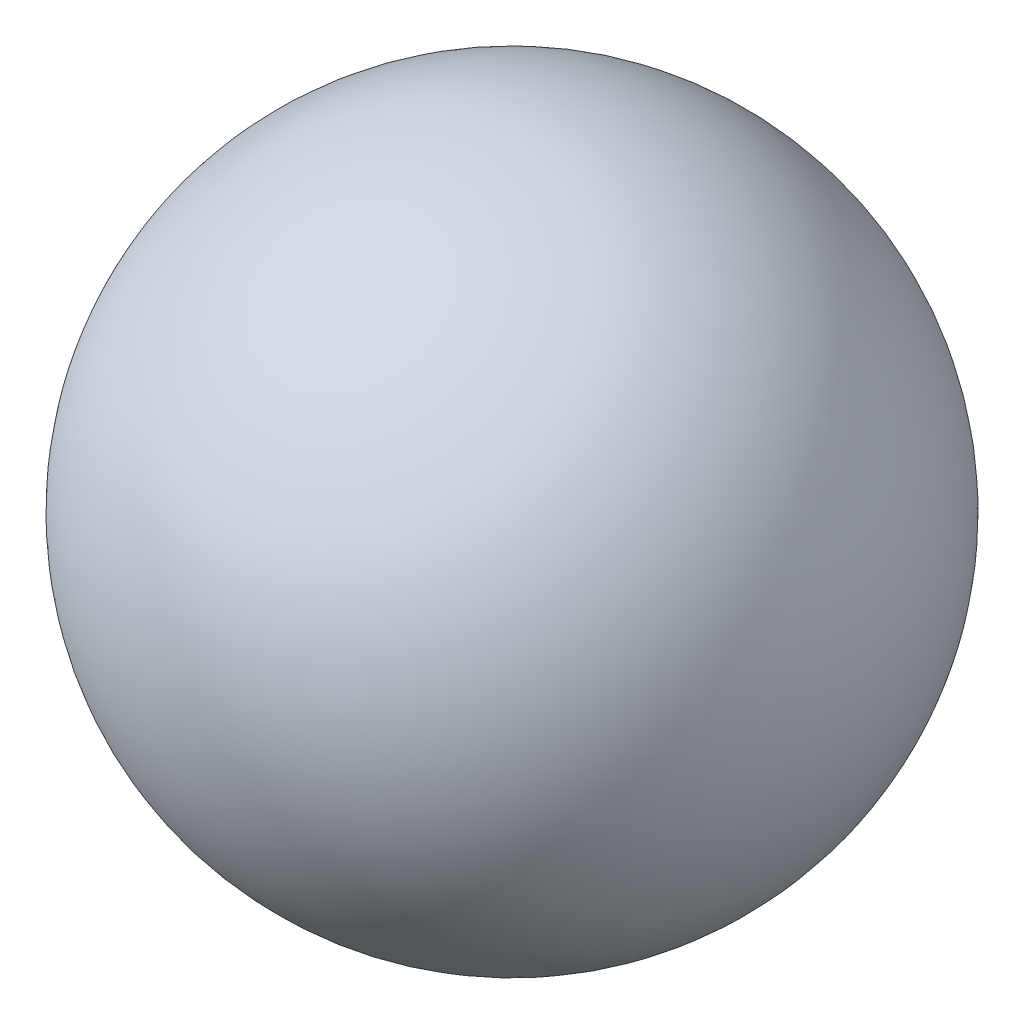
from build123d import *


with BuildPart() as part:
    # Esquisse1 → Base-R_volution (revolve)
    with BuildSketch(Plane(origin=(0, 0, 0), x_dir=(1, 0, 0), z_dir=(0, 1, 0))):
        with BuildLine():
            Line((0.95, 2.05), (3.65, 2.05))
            ThreePointArc((3.65, 2.05), (2.3, 3.4), (0.95, 2.05))
        make_face()
    revolve(axis=Axis((-0.2, 0, -2.05), (1, 0, 0)))


solid = part.part
